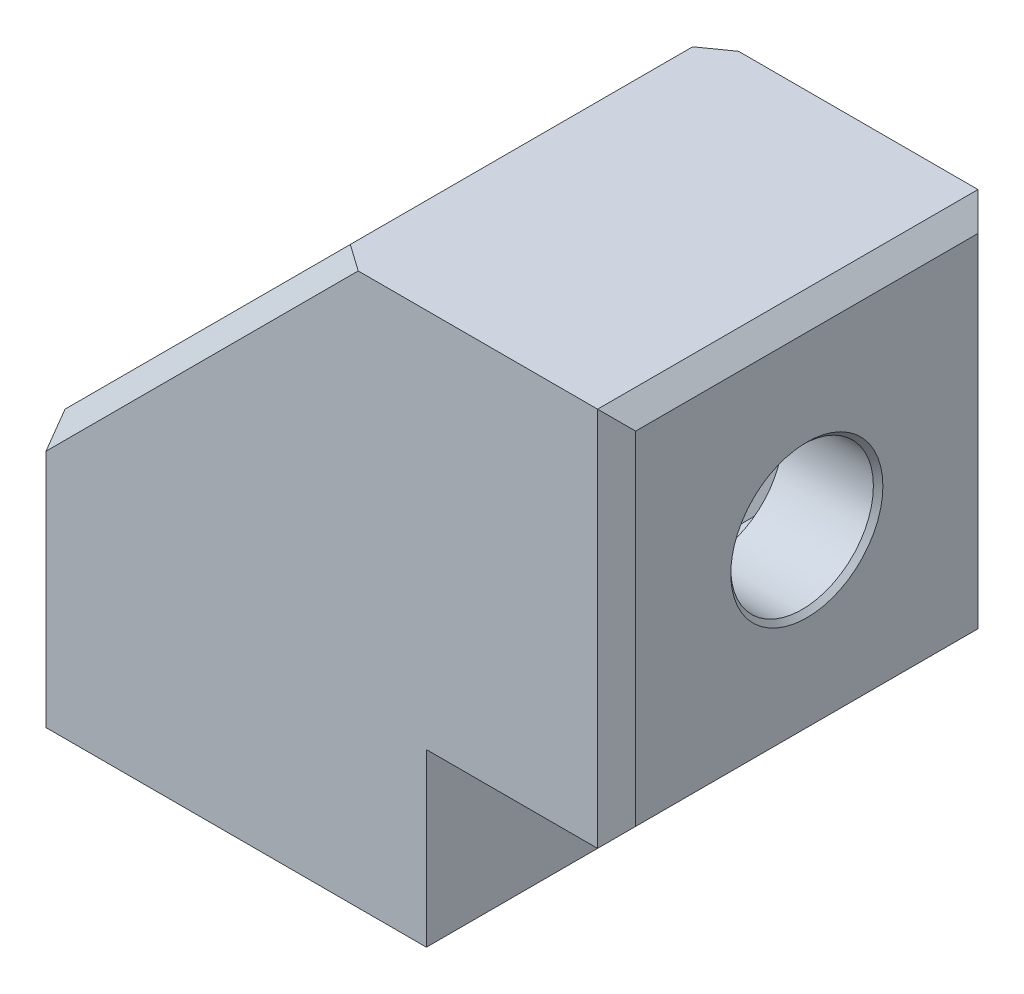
ISO-10303-21;
HEADER;
FILE_DESCRIPTION(('STEP AP214'),'2;1');
FILE_NAME('part.step','',(''),(''),'','','');
FILE_SCHEMA(('AUTOMOTIVE_DESIGN { 1 0 10303 214 1 1 1 1 }'));
ENDSEC;
DATA;
#1=APPLICATION_CONTEXT('core data for automotive mechanical design processes');
#2=APPLICATION_PROTOCOL_DEFINITION('international standard','automotive_design',2000,#1);
#3=PRODUCT_CONTEXT('',#1,'mechanical');
#4=PRODUCT('Part','Part','',(#3));
#5=PRODUCT_RELATED_PRODUCT_CATEGORY('part','',(#4));
#6=PRODUCT_DEFINITION_FORMATION('','',#4);
#7=PRODUCT_DEFINITION_CONTEXT('part definition',#1,'design');
#8=PRODUCT_DEFINITION('design','',#6,#7);
#9=PRODUCT_DEFINITION_SHAPE('','',#8);
#10=(LENGTH_UNIT() NAMED_UNIT(*) SI_UNIT(.MILLI.,.METRE.));
#11=(NAMED_UNIT(*) PLANE_ANGLE_UNIT() SI_UNIT($,.RADIAN.));
#12=(NAMED_UNIT(*) SI_UNIT($,.STERADIAN.) SOLID_ANGLE_UNIT());
#13=UNCERTAINTY_MEASURE_WITH_UNIT(LENGTH_MEASURE(1.E-05),#10,'distance_accuracy_value','');
#14=(GEOMETRIC_REPRESENTATION_CONTEXT(3) GLOBAL_UNCERTAINTY_ASSIGNED_CONTEXT((#13)) GLOBAL_UNIT_ASSIGNED_CONTEXT((#10,
#11,#12)) REPRESENTATION_CONTEXT('',''));
#15=CARTESIAN_POINT('',(0.,0.,0.));
#16=DIRECTION('',(0.,0.,1.));
#17=DIRECTION('',(1.,0.,0.));
#18=AXIS2_PLACEMENT_3D('',#15,#16,#17);
#19=CARTESIAN_POINT('',(0.,0.,50.8));
#20=DIRECTION('',(1.,0.,0.));
#21=DIRECTION('',(0.,0.,-1.));
#22=AXIS2_PLACEMENT_3D('',#19,#20,#21);
#23=PLANE('',#22);
#24=DIRECTION('',(0.,0.,-1.));
#25=VECTOR('',#24,1.);
#26=CARTESIAN_POINT('',(0.,38.1,50.8));
#27=LINE('',#26,#25);
#28=CARTESIAN_POINT('',(0.,38.1,48.26));
#29=VERTEX_POINT('',#28);
#30=CARTESIAN_POINT('',(0.,38.1,2.54));
#31=VERTEX_POINT('',#30);
#32=EDGE_CURVE('E230',#29,#31,#27,.T.);
#33=ORIENTED_EDGE('',*,*,#32,.T.);
#34=DIRECTION('',(0.,-0.816496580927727,-0.577350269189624));
#35=VECTOR('',#34,1.);
#36=CARTESIAN_POINT('',(0.,38.1,2.54));
#37=LINE('',#36,#35);
#38=CARTESIAN_POINT('',(0.,34.5078975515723,0.));
#39=VERTEX_POINT('',#38);
#40=EDGE_CURVE('E387',#31,#39,#37,.T.);
#41=ORIENTED_EDGE('',*,*,#40,.T.);
#42=DIRECTION('',(0.,-1.,0.));
#43=VECTOR('',#42,1.);
#44=CARTESIAN_POINT('',(0.,0.,0.));
#45=LINE('',#44,#43);
#46=CARTESIAN_POINT('',(0.,2.54,0.));
#47=VERTEX_POINT('',#46);
#48=EDGE_CURVE('E234',#39,#47,#45,.T.);
#49=ORIENTED_EDGE('',*,*,#48,.T.);
#50=DIRECTION('',(0.,0.,1.));
#51=VECTOR('',#50,1.);
#52=CARTESIAN_POINT('',(0.,2.54,50.8));
#53=LINE('',#52,#51);
#54=CARTESIAN_POINT('',(0.,2.54,50.8));
#55=VERTEX_POINT('',#54);
#56=EDGE_CURVE('E380',#47,#55,#53,.T.);
#57=ORIENTED_EDGE('',*,*,#56,.T.);
#58=DIRECTION('',(0.,-1.,0.));
#59=VECTOR('',#58,1.);
#60=CARTESIAN_POINT('',(0.,0.,50.8));
#61=LINE('',#60,#59);
#62=CARTESIAN_POINT('',(0.,34.5078975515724,50.8));
#63=VERTEX_POINT('',#62);
#64=EDGE_CURVE('E207',#63,#55,#61,.T.);
#65=ORIENTED_EDGE('',*,*,#64,.F.);
#66=DIRECTION('',(0.,-0.816496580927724,0.577350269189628));
#67=VECTOR('',#66,1.);
#68=CARTESIAN_POINT('',(0.,23.0052650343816,58.9335894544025));
#69=LINE('',#68,#67);
#70=EDGE_CURVE('E384',#63,#29,#69,.F.);
#71=ORIENTED_EDGE('',*,*,#70,.T.);
#72=EDGE_LOOP('',(#33,#41,#49,#57,#65,#71));
#73=FACE_BOUND('',#72,.T.);
#74=ADVANCED_FACE('F55',(#73),#23,.F.);
#75=CARTESIAN_POINT('',(0.,0.,50.8));
#76=DIRECTION('',(0.,1.,0.));
#77=DIRECTION('',(-1.,0.,0.));
#78=AXIS2_PLACEMENT_3D('',#75,#76,#77);
#79=PLANE('',#78);
#80=DIRECTION('',(-1.,0.,0.));
#81=VECTOR('',#80,1.);
#82=CARTESIAN_POINT('',(0.,0.,48.26));
#83=LINE('',#82,#81);
#84=CARTESIAN_POINT('',(48.26,0.,48.26));
#85=VERTEX_POINT('',#84);
#86=CARTESIAN_POINT('',(2.54000000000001,0.,48.26));
#87=VERTEX_POINT('',#86);
#88=EDGE_CURVE('E390',#85,#87,#83,.T.);
#89=ORIENTED_EDGE('',*,*,#88,.T.);
#90=DIRECTION('',(0.,0.,-1.));
#91=VECTOR('',#90,1.);
#92=CARTESIAN_POINT('',(2.54000000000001,0.,50.8));
#93=LINE('',#92,#91);
#94=CARTESIAN_POINT('',(2.54000000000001,0.,2.54000000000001));
#95=VERTEX_POINT('',#94);
#96=EDGE_CURVE('E65',#87,#95,#93,.T.);
#97=ORIENTED_EDGE('',*,*,#96,.T.);
#98=DIRECTION('',(1.,0.,0.));
#99=VECTOR('',#98,1.);
#100=CARTESIAN_POINT('',(50.8,0.,2.54000000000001));
#101=LINE('',#100,#99);
#102=CARTESIAN_POINT('',(48.26,0.,2.54000000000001));
#103=VERTEX_POINT('',#102);
#104=EDGE_CURVE('E80',#95,#103,#101,.T.);
#105=ORIENTED_EDGE('',*,*,#104,.T.);
#106=DIRECTION('',(0.,0.,1.));
#107=VECTOR('',#106,1.);
#108=CARTESIAN_POINT('',(48.26,0.,50.8));
#109=LINE('',#108,#107);
#110=EDGE_CURVE('E393',#103,#85,#109,.T.);
#111=ORIENTED_EDGE('',*,*,#110,.T.);
#112=EDGE_LOOP('',(#89,#97,#105,#111));
#113=FACE_BOUND('',#112,.T.);
#114=CARTESIAN_POINT('',(25.4,0.,25.4));
#115=DIRECTION('',(0.,-1.,0.));
#116=DIRECTION('',(0.,0.,-1.));
#117=AXIS2_PLACEMENT_3D('',#114,#115,#116);
#118=CIRCLE('',#117,10.16);
#119=CARTESIAN_POINT('',(25.4,0.,15.24));
#120=VERTEX_POINT('',#119);
#121=EDGE_CURVE('E579',#120,#120,#118,.T.);
#122=ORIENTED_EDGE('',*,*,#121,.F.);
#123=EDGE_LOOP('',(#122));
#124=FACE_BOUND('',#123,.T.);
#125=ADVANCED_FACE('F477',(#113,#124),#79,.F.);
#126=CARTESIAN_POINT('',(50.8,0.,50.8));
#127=DIRECTION('',(-1.,0.,0.));
#128=DIRECTION('',(0.,0.,1.));
#129=AXIS2_PLACEMENT_3D('',#126,#127,#128);
#130=PLANE('',#129);
#131=DIRECTION('',(0.,1.,0.));
#132=VECTOR('',#131,1.);
#133=CARTESIAN_POINT('',(50.8,0.,50.8));
#134=LINE('',#133,#132);
#135=CARTESIAN_POINT('',(50.8,2.54000000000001,50.8));
#136=VERTEX_POINT('',#135);
#137=CARTESIAN_POINT('',(50.8,25.4,50.8));
#138=VERTEX_POINT('',#137);
#139=EDGE_CURVE('E196',#136,#138,#134,.T.);
#140=ORIENTED_EDGE('',*,*,#139,.F.);
#141=DIRECTION('',(0.,0.,-1.));
#142=VECTOR('',#141,1.);
#143=CARTESIAN_POINT('',(50.8,2.54000000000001,50.8));
#144=LINE('',#143,#142);
#145=CARTESIAN_POINT('',(50.8,2.54000000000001,0.));
#146=VERTEX_POINT('',#145);
#147=EDGE_CURVE('E13',#136,#146,#144,.T.);
#148=ORIENTED_EDGE('',*,*,#147,.T.);
#149=DIRECTION('',(0.,1.,0.));
#150=VECTOR('',#149,1.);
#151=CARTESIAN_POINT('',(50.8,0.,0.));
#152=LINE('',#151,#150);
#153=CARTESIAN_POINT('',(50.8,25.4,0.));
#154=VERTEX_POINT('',#153);
#155=EDGE_CURVE('E213',#146,#154,#152,.T.);
#156=ORIENTED_EDGE('',*,*,#155,.T.);
#157=DIRECTION('',(0.,0.,-1.));
#158=VECTOR('',#157,1.);
#159=CARTESIAN_POINT('',(50.8,25.4,50.8));
#160=LINE('',#159,#158);
#161=EDGE_CURVE('E210',#138,#154,#160,.T.);
#162=ORIENTED_EDGE('',*,*,#161,.F.);
#163=EDGE_LOOP('',(#140,#148,#156,#162));
#164=FACE_BOUND('',#163,.T.);
#165=ADVANCED_FACE('F211',(#164),#130,.F.);
#166=CARTESIAN_POINT('',(76.2,25.4,50.8));
#167=DIRECTION('',(0.,1.,0.));
#168=DIRECTION('',(-1.,0.,0.));
#169=AXIS2_PLACEMENT_3D('',#166,#167,#168);
#170=PLANE('',#169);
#171=DIRECTION('',(1.,0.,0.));
#172=VECTOR('',#171,1.);
#173=CARTESIAN_POINT('',(76.2,25.4,0.));
#174=LINE('',#173,#172);
#175=CARTESIAN_POINT('',(73.66,25.4,0.));
#176=VERTEX_POINT('',#175);
#177=EDGE_CURVE('E241',#154,#176,#174,.T.);
#178=ORIENTED_EDGE('',*,*,#177,.T.);
#179=DIRECTION('',(0.,0.,1.));
#180=VECTOR('',#179,1.);
#181=CARTESIAN_POINT('',(73.66,25.4,50.8));
#182=LINE('',#181,#180);
#183=CARTESIAN_POINT('',(73.66,25.4,50.8));
#184=VERTEX_POINT('',#183);
#185=EDGE_CURVE('E224',#176,#184,#182,.T.);
#186=ORIENTED_EDGE('',*,*,#185,.T.);
#187=DIRECTION('',(1.,0.,0.));
#188=VECTOR('',#187,1.);
#189=CARTESIAN_POINT('',(76.2,25.4,50.8));
#190=LINE('',#189,#188);
#191=EDGE_CURVE('E200',#138,#184,#190,.T.);
#192=ORIENTED_EDGE('',*,*,#191,.F.);
#193=ORIENTED_EDGE('',*,*,#161,.T.);
#194=EDGE_LOOP('',(#178,#186,#192,#193));
#195=FACE_BOUND('',#194,.T.);
#196=ADVANCED_FACE('F222',(#195),#170,.F.);
#197=CARTESIAN_POINT('',(76.2,25.4,50.8));
#198=DIRECTION('',(-1.,0.,0.));
#199=DIRECTION('',(0.,0.,1.));
#200=AXIS2_PLACEMENT_3D('',#197,#198,#199);
#201=PLANE('',#200);
#202=DIRECTION('',(0.,-1.,0.));
#203=VECTOR('',#202,1.);
#204=CARTESIAN_POINT('',(76.2,25.4,48.26));
#205=LINE('',#204,#203);
#206=CARTESIAN_POINT('',(76.2,73.66,48.26));
#207=VERTEX_POINT('',#206);
#208=CARTESIAN_POINT('',(76.2,27.94,48.26));
#209=VERTEX_POINT('',#208);
#210=EDGE_CURVE('E337',#207,#209,#205,.T.);
#211=ORIENTED_EDGE('',*,*,#210,.T.);
#212=DIRECTION('',(0.,0.,-1.));
#213=VECTOR('',#212,1.);
#214=CARTESIAN_POINT('',(76.2,27.94,50.8));
#215=LINE('',#214,#213);
#216=CARTESIAN_POINT('',(76.2,27.94,2.54));
#217=VERTEX_POINT('',#216);
#218=EDGE_CURVE('E340',#209,#217,#215,.T.);
#219=ORIENTED_EDGE('',*,*,#218,.T.);
#220=DIRECTION('',(0.,1.,0.));
#221=VECTOR('',#220,1.);
#222=CARTESIAN_POINT('',(76.2,76.2,2.54));
#223=LINE('',#222,#221);
#224=CARTESIAN_POINT('',(76.2,73.66,2.54));
#225=VERTEX_POINT('',#224);
#226=EDGE_CURVE('E257',#217,#225,#223,.T.);
#227=ORIENTED_EDGE('',*,*,#226,.T.);
#228=DIRECTION('',(0.,0.,1.));
#229=VECTOR('',#228,1.);
#230=CARTESIAN_POINT('',(76.2,73.66,50.8));
#231=LINE('',#230,#229);
#232=EDGE_CURVE('E334',#225,#207,#231,.T.);
#233=ORIENTED_EDGE('',*,*,#232,.T.);
#234=EDGE_LOOP('',(#211,#219,#227,#233));
#235=FACE_BOUND('',#234,.T.);
#236=CARTESIAN_POINT('',(76.2,50.8,25.4));
#237=DIRECTION('',(1.,0.,0.));
#238=DIRECTION('',(0.,0.,-1.));
#239=AXIS2_PLACEMENT_3D('',#236,#237,#238);
#240=CIRCLE('',#239,10.16);
#241=CARTESIAN_POINT('',(76.2,50.8,15.24));
#242=VERTEX_POINT('',#241);
#243=EDGE_CURVE('E598',#242,#242,#240,.T.);
#244=ORIENTED_EDGE('',*,*,#243,.F.);
#245=EDGE_LOOP('',(#244));
#246=FACE_BOUND('',#245,.T.);
#247=ADVANCED_FACE('F449',(#235,#246),#201,.F.);
#248=CARTESIAN_POINT('',(38.1,76.2,50.8));
#249=DIRECTION('',(0.,-1.,0.));
#250=DIRECTION('',(0.,0.,-1.));
#251=AXIS2_PLACEMENT_3D('',#248,#249,#250);
#252=PLANE('',#251);
#253=DIRECTION('',(-1.,0.,0.));
#254=VECTOR('',#253,1.);
#255=CARTESIAN_POINT('',(38.1,76.2,50.8));
#256=LINE('',#255,#254);
#257=CARTESIAN_POINT('',(73.66,76.2,50.8));
#258=VERTEX_POINT('',#257);
#259=CARTESIAN_POINT('',(41.6921024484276,76.2,50.8));
#260=VERTEX_POINT('',#259);
#261=EDGE_CURVE('E226',#258,#260,#256,.T.);
#262=ORIENTED_EDGE('',*,*,#261,.F.);
#263=DIRECTION('',(0.,0.,-1.));
#264=VECTOR('',#263,1.);
#265=CARTESIAN_POINT('',(73.66,76.2,50.8));
#266=LINE('',#265,#264);
#267=CARTESIAN_POINT('',(73.66,76.2,0.));
#268=VERTEX_POINT('',#267);
#269=EDGE_CURVE('E361',#258,#268,#266,.T.);
#270=ORIENTED_EDGE('',*,*,#269,.T.);
#271=DIRECTION('',(-1.,0.,0.));
#272=VECTOR('',#271,1.);
#273=CARTESIAN_POINT('',(38.1,76.2,0.));
#274=LINE('',#273,#272);
#275=CARTESIAN_POINT('',(41.6921024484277,76.2,0.));
#276=VERTEX_POINT('',#275);
#277=EDGE_CURVE('E244',#268,#276,#274,.T.);
#278=ORIENTED_EDGE('',*,*,#277,.T.);
#279=DIRECTION('',(-0.816496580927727,0.,0.577350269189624));
#280=VECTOR('',#279,1.);
#281=CARTESIAN_POINT('',(12.6999999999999,76.2,20.5005122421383));
#282=LINE('',#281,#280);
#283=CARTESIAN_POINT('',(38.1,76.2,2.54));
#284=VERTEX_POINT('',#283);
#285=EDGE_CURVE('E358',#276,#284,#282,.T.);
#286=ORIENTED_EDGE('',*,*,#285,.T.);
#287=DIRECTION('',(0.,0.,-1.));
#288=VECTOR('',#287,1.);
#289=CARTESIAN_POINT('',(38.1,76.2,50.8));
#290=LINE('',#289,#288);
#291=CARTESIAN_POINT('',(38.1,76.2,48.26));
#292=VERTEX_POINT('',#291);
#293=EDGE_CURVE('E219',#292,#284,#290,.T.);
#294=ORIENTED_EDGE('',*,*,#293,.F.);
#295=DIRECTION('',(-0.816496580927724,0.,-0.577350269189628));
#296=VECTOR('',#295,1.);
#297=CARTESIAN_POINT('',(2.3947349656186,76.2,23.0125649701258));
#298=LINE('',#297,#296);
#299=EDGE_CURVE('E355',#292,#260,#298,.F.);
#300=ORIENTED_EDGE('',*,*,#299,.T.);
#301=EDGE_LOOP('',(#262,#270,#278,#286,#294,#300));
#302=FACE_BOUND('',#301,.T.);
#303=ADVANCED_FACE('F459',(#302),#252,.F.);
#304=CARTESIAN_POINT('',(0.,38.1,50.8));
#305=DIRECTION('',(0.707106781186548,-0.707106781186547,0.));
#306=DIRECTION('',(0.707106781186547,0.707106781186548,0.));
#307=AXIS2_PLACEMENT_3D('',#304,#305,#306);
#308=PLANE('',#307);
#309=CARTESIAN_POINT('',(30.0177694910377,68.1177694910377,25.4));
#310=DIRECTION('',(-0.707106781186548,0.707106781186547,0.));
#311=DIRECTION('',(-0.707106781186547,-0.707106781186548,0.));
#312=AXIS2_PLACEMENT_3D('',#309,#310,#311);
#313=CIRCLE('',#312,2.55269999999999);
#314=CARTESIAN_POINT('',(28.2127380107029,66.3127380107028,25.4));
#315=VERTEX_POINT('',#314);
#316=EDGE_CURVE('E331',#315,#315,#313,.T.);
#317=ORIENTED_EDGE('',*,*,#316,.F.);
#318=EDGE_LOOP('',(#317));
#319=FACE_BOUND('',#318,.T.);
#320=CARTESIAN_POINT('',(18.3434365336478,56.4434365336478,25.4));
#321=DIRECTION('',(-0.707106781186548,0.707106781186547,0.));
#322=DIRECTION('',(-0.707106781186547,-0.707106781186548,0.));
#323=AXIS2_PLACEMENT_3D('',#320,#321,#322);
#324=CIRCLE('',#323,10.16);
#325=CARTESIAN_POINT('',(11.1592316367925,49.2592316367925,25.4));
#326=VERTEX_POINT('',#325);
#327=EDGE_CURVE('E330',#326,#326,#324,.T.);
#328=ORIENTED_EDGE('',*,*,#327,.F.);
#329=EDGE_LOOP('',(#328));
#330=FACE_BOUND('',#329,.T.);
#331=ORIENTED_EDGE('',*,*,#293,.T.);
#332=DIRECTION('',(-0.707106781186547,-0.707106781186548,0.));
#333=VECTOR('',#332,1.);
#334=CARTESIAN_POINT('',(0.,38.1,2.54));
#335=LINE('',#334,#333);
#336=EDGE_CURVE('E376',#284,#31,#335,.T.);
#337=ORIENTED_EDGE('',*,*,#336,.T.);
#338=ORIENTED_EDGE('',*,*,#32,.F.);
#339=DIRECTION('',(0.707106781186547,0.707106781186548,0.));
#340=VECTOR('',#339,1.);
#341=CARTESIAN_POINT('',(0.,38.1,48.26));
#342=LINE('',#341,#340);
#343=EDGE_CURVE('E373',#29,#292,#342,.T.);
#344=ORIENTED_EDGE('',*,*,#343,.T.);
#345=EDGE_LOOP('',(#331,#337,#338,#344));
#346=FACE_BOUND('',#345,.T.);
#347=ADVANCED_FACE('F615',(#319,#330,#346),#308,.F.);
#348=CARTESIAN_POINT('',(0.,0.,50.8));
#349=DIRECTION('',(0.,0.,-1.));
#350=DIRECTION('',(-1.,0.,0.));
#351=AXIS2_PLACEMENT_3D('',#348,#349,#350);
#352=PLANE('',#351);
#353=ORIENTED_EDGE('',*,*,#191,.T.);
#354=DIRECTION('',(0.,1.,0.));
#355=VECTOR('',#354,1.);
#356=CARTESIAN_POINT('',(73.66,0.,50.8));
#357=LINE('',#356,#355);
#358=EDGE_CURVE('E352',#184,#258,#357,.T.);
#359=ORIENTED_EDGE('',*,*,#358,.T.);
#360=ORIENTED_EDGE('',*,*,#261,.T.);
#361=DIRECTION('',(-0.707106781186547,-0.707106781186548,0.));
#362=VECTOR('',#361,1.);
#363=CARTESIAN_POINT('',(-17.2539487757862,17.2539487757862,50.8));
#364=LINE('',#363,#362);
#365=EDGE_CURVE('E348',#260,#63,#364,.T.);
#366=ORIENTED_EDGE('',*,*,#365,.T.);
#367=ORIENTED_EDGE('',*,*,#64,.T.);
#368=DIRECTION('',(1.,0.,0.));
#369=VECTOR('',#368,1.);
#370=CARTESIAN_POINT('',(0.,2.54,50.8));
#371=LINE('',#370,#369);
#372=EDGE_CURVE('E203',#55,#136,#371,.T.);
#373=ORIENTED_EDGE('',*,*,#372,.T.);
#374=ORIENTED_EDGE('',*,*,#139,.T.);
#375=EDGE_LOOP('',(#353,#359,#360,#366,#367,#373,#374));
#376=FACE_BOUND('',#375,.T.);
#377=ADVANCED_FACE('F198',(#376),#352,.F.);
#378=CARTESIAN_POINT('',(0.,0.,0.));
#379=DIRECTION('',(0.,0.,-1.));
#380=DIRECTION('',(-1.,0.,0.));
#381=AXIS2_PLACEMENT_3D('',#378,#379,#380);
#382=PLANE('',#381);
#383=ORIENTED_EDGE('',*,*,#277,.F.);
#384=DIRECTION('',(0.,-1.,0.));
#385=VECTOR('',#384,1.);
#386=CARTESIAN_POINT('',(73.66,25.4,0.));
#387=LINE('',#386,#385);
#388=EDGE_CURVE('E370',#268,#176,#387,.T.);
#389=ORIENTED_EDGE('',*,*,#388,.T.);
#390=ORIENTED_EDGE('',*,*,#177,.F.);
#391=ORIENTED_EDGE('',*,*,#155,.F.);
#392=DIRECTION('',(-1.,0.,0.));
#393=VECTOR('',#392,1.);
#394=CARTESIAN_POINT('',(0.,2.54,0.));
#395=LINE('',#394,#393);
#396=EDGE_CURVE('E364',#146,#47,#395,.T.);
#397=ORIENTED_EDGE('',*,*,#396,.T.);
#398=ORIENTED_EDGE('',*,*,#48,.F.);
#399=DIRECTION('',(0.707106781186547,0.707106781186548,0.));
#400=VECTOR('',#399,1.);
#401=CARTESIAN_POINT('',(39.8960512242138,74.4039487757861,0.));
#402=LINE('',#401,#400);
#403=EDGE_CURVE('E367',#39,#276,#402,.T.);
#404=ORIENTED_EDGE('',*,*,#403,.T.);
#405=EDGE_LOOP('',(#383,#389,#390,#391,#397,#398,#404));
#406=FACE_BOUND('',#405,.T.);
#407=ADVANCED_FACE('F434',(#406),#382,.T.);
#408=CARTESIAN_POINT('',(76.2,50.8,25.4));
#409=DIRECTION('',(1.,0.,0.));
#410=DIRECTION('',(0.,0.,-1.));
#411=AXIS2_PLACEMENT_3D('',#408,#409,#410);
#412=CYLINDRICAL_SURFACE('',#411,9.525);
#413=CARTESIAN_POINT('',(75.565,50.8,25.4));
#414=DIRECTION('',(1.,0.,0.));
#415=DIRECTION('',(0.,0.,-1.));
#416=AXIS2_PLACEMENT_3D('',#413,#414,#415);
#417=CIRCLE('',#416,9.52499999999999);
#418=CARTESIAN_POINT('',(75.565,50.8,15.875));
#419=VERTEX_POINT('',#418);
#420=EDGE_CURVE('E602',#419,#419,#417,.T.);
#421=ORIENTED_EDGE('',*,*,#420,.T.);
#422=EDGE_LOOP('',(#421));
#423=FACE_BOUND('',#422,.T.);
#424=CARTESIAN_POINT('',(63.5,50.8,25.4));
#425=DIRECTION('',(-1.,0.,0.));
#426=DIRECTION('',(0.,0.,1.));
#427=AXIS2_PLACEMENT_3D('',#424,#425,#426);
#428=CIRCLE('',#427,9.525);
#429=CARTESIAN_POINT('',(63.5,50.8,34.925));
#430=VERTEX_POINT('',#429);
#431=EDGE_CURVE('E238',#430,#430,#428,.T.);
#432=ORIENTED_EDGE('',*,*,#431,.T.);
#433=EDGE_LOOP('',(#432));
#434=FACE_BOUND('',#433,.T.);
#435=ADVANCED_FACE('F667',(#423,#434),#412,.F.);
#436=CARTESIAN_POINT('',(76.2,50.8,25.4));
#437=DIRECTION('',(1.,0.,0.));
#438=DIRECTION('',(0.,0.,-1.));
#439=AXIS2_PLACEMENT_3D('',#436,#437,#438);
#440=CONICAL_SURFACE('',#439,10.16,0.785398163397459);
#441=ORIENTED_EDGE('',*,*,#420,.F.);
#442=EDGE_LOOP('',(#441));
#443=FACE_BOUND('',#442,.T.);
#444=ORIENTED_EDGE('',*,*,#243,.T.);
#445=EDGE_LOOP('',(#444));
#446=FACE_BOUND('',#445,.T.);
#447=ADVANCED_FACE('F490',(#443,#446),#440,.F.);
#448=CARTESIAN_POINT('',(2.54,0.,50.8));
#449=DIRECTION('',(1.,0.,0.));
#450=DIRECTION('',(0.,0.,-1.));
#451=AXIS2_PLACEMENT_3D('',#448,#449,#450);
#452=PLANE('',#451);
#453=DIRECTION('',(0.,-1.,0.));
#454=VECTOR('',#453,1.);
#455=CARTESIAN_POINT('',(2.54,0.,2.54));
#456=LINE('',#455,#454);
#457=CARTESIAN_POINT('',(2.54,37.0478975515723,2.54));
#458=VERTEX_POINT('',#457);
#459=CARTESIAN_POINT('',(2.54,12.7,2.54));
#460=VERTEX_POINT('',#459);
#461=EDGE_CURVE('E218',#458,#460,#456,.T.);
#462=ORIENTED_EDGE('',*,*,#461,.F.);
#463=DIRECTION('',(0.,0.,-1.));
#464=VECTOR('',#463,1.);
#465=CARTESIAN_POINT('',(2.54,37.0478975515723,50.8));
#466=LINE('',#465,#464);
#467=CARTESIAN_POINT('',(2.54,37.0478975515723,48.26));
#468=VERTEX_POINT('',#467);
#469=EDGE_CURVE('E319',#468,#458,#466,.T.);
#470=ORIENTED_EDGE('',*,*,#469,.F.);
#471=DIRECTION('',(0.,-1.,0.));
#472=VECTOR('',#471,1.);
#473=CARTESIAN_POINT('',(2.54,0.,48.26));
#474=LINE('',#473,#472);
#475=CARTESIAN_POINT('',(2.54,12.7,48.26));
#476=VERTEX_POINT('',#475);
#477=EDGE_CURVE('E273',#468,#476,#474,.T.);
#478=ORIENTED_EDGE('',*,*,#477,.T.);
#479=DIRECTION('',(0.,0.,-1.));
#480=VECTOR('',#479,1.);
#481=CARTESIAN_POINT('',(2.54,12.7,50.8));
#482=LINE('',#481,#480);
#483=EDGE_CURVE('E312',#476,#460,#482,.T.);
#484=ORIENTED_EDGE('',*,*,#483,.T.);
#485=EDGE_LOOP('',(#462,#470,#478,#484));
#486=FACE_BOUND('',#485,.T.);
#487=ADVANCED_FACE('F486',(#486),#452,.T.);
#488=CARTESIAN_POINT('',(0.,12.7,50.8));
#489=DIRECTION('',(0.,1.,0.));
#490=DIRECTION('',(-1.,0.,0.));
#491=AXIS2_PLACEMENT_3D('',#488,#489,#490);
#492=PLANE('',#491);
#493=CARTESIAN_POINT('',(25.4,12.7,25.4));
#494=DIRECTION('',(0.,1.,0.));
#495=DIRECTION('',(-1.,0.,0.));
#496=AXIS2_PLACEMENT_3D('',#493,#494,#495);
#497=CIRCLE('',#496,9.52499999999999);
#498=CARTESIAN_POINT('',(15.875,12.7,25.4));
#499=VERTEX_POINT('',#498);
#500=EDGE_CURVE('E588',#499,#499,#497,.T.);
#501=ORIENTED_EDGE('',*,*,#500,.F.);
#502=EDGE_LOOP('',(#501));
#503=FACE_BOUND('',#502,.T.);
#504=DIRECTION('',(1.,0.,0.));
#505=VECTOR('',#504,1.);
#506=CARTESIAN_POINT('',(0.,12.7,2.54));
#507=LINE('',#506,#505);
#508=CARTESIAN_POINT('',(48.26,12.7,2.54));
#509=VERTEX_POINT('',#508);
#510=EDGE_CURVE('E316',#460,#509,#507,.T.);
#511=ORIENTED_EDGE('',*,*,#510,.F.);
#512=ORIENTED_EDGE('',*,*,#483,.F.);
#513=DIRECTION('',(1.,0.,0.));
#514=VECTOR('',#513,1.);
#515=CARTESIAN_POINT('',(0.,12.7,48.26));
#516=LINE('',#515,#514);
#517=CARTESIAN_POINT('',(48.26,12.7,48.26));
#518=VERTEX_POINT('',#517);
#519=EDGE_CURVE('E270',#476,#518,#516,.T.);
#520=ORIENTED_EDGE('',*,*,#519,.T.);
#521=DIRECTION('',(0.,0.,-1.));
#522=VECTOR('',#521,1.);
#523=CARTESIAN_POINT('',(48.26,12.7,50.8));
#524=LINE('',#523,#522);
#525=EDGE_CURVE('E305',#518,#509,#524,.T.);
#526=ORIENTED_EDGE('',*,*,#525,.T.);
#527=EDGE_LOOP('',(#511,#512,#520,#526));
#528=FACE_BOUND('',#527,.T.);
#529=ADVANCED_FACE('F489',(#503,#528),#492,.T.);
#530=CARTESIAN_POINT('',(48.26,0.,50.8));
#531=DIRECTION('',(-1.,0.,0.));
#532=DIRECTION('',(0.,0.,1.));
#533=AXIS2_PLACEMENT_3D('',#530,#531,#532);
#534=PLANE('',#533);
#535=DIRECTION('',(0.,1.,0.));
#536=VECTOR('',#535,1.);
#537=CARTESIAN_POINT('',(48.26,0.,2.54));
#538=LINE('',#537,#536);
#539=CARTESIAN_POINT('',(48.26,27.94,2.54));
#540=VERTEX_POINT('',#539);
#541=EDGE_CURVE('E309',#509,#540,#538,.T.);
#542=ORIENTED_EDGE('',*,*,#541,.F.);
#543=ORIENTED_EDGE('',*,*,#525,.F.);
#544=DIRECTION('',(0.,1.,0.));
#545=VECTOR('',#544,1.);
#546=CARTESIAN_POINT('',(48.26,0.,48.26));
#547=LINE('',#546,#545);
#548=CARTESIAN_POINT('',(48.26,27.94,48.26));
#549=VERTEX_POINT('',#548);
#550=EDGE_CURVE('E267',#518,#549,#547,.T.);
#551=ORIENTED_EDGE('',*,*,#550,.T.);
#552=DIRECTION('',(0.,0.,-1.));
#553=VECTOR('',#552,1.);
#554=CARTESIAN_POINT('',(48.26,27.94,50.8));
#555=LINE('',#554,#553);
#556=EDGE_CURVE('E298',#549,#540,#555,.T.);
#557=ORIENTED_EDGE('',*,*,#556,.T.);
#558=EDGE_LOOP('',(#542,#543,#551,#557));
#559=FACE_BOUND('',#558,.T.);
#560=ADVANCED_FACE('F494',(#559),#534,.T.);
#561=CARTESIAN_POINT('',(76.2,27.94,50.8));
#562=DIRECTION('',(0.,1.,0.));
#563=DIRECTION('',(-1.,0.,0.));
#564=AXIS2_PLACEMENT_3D('',#561,#562,#563);
#565=PLANE('',#564);
#566=DIRECTION('',(1.,0.,0.));
#567=VECTOR('',#566,1.);
#568=CARTESIAN_POINT('',(0.,27.94,2.54));
#569=LINE('',#568,#567);
#570=CARTESIAN_POINT('',(63.5,27.94,2.54));
#571=VERTEX_POINT('',#570);
#572=EDGE_CURVE('E302',#540,#571,#569,.T.);
#573=ORIENTED_EDGE('',*,*,#572,.F.);
#574=ORIENTED_EDGE('',*,*,#556,.F.);
#575=DIRECTION('',(1.,0.,0.));
#576=VECTOR('',#575,1.);
#577=CARTESIAN_POINT('',(0.,27.94,48.26));
#578=LINE('',#577,#576);
#579=CARTESIAN_POINT('',(63.5,27.94,48.26));
#580=VERTEX_POINT('',#579);
#581=EDGE_CURVE('E264',#549,#580,#578,.T.);
#582=ORIENTED_EDGE('',*,*,#581,.T.);
#583=DIRECTION('',(0.,0.,-1.));
#584=VECTOR('',#583,1.);
#585=CARTESIAN_POINT('',(63.5,27.94,50.8));
#586=LINE('',#585,#584);
#587=EDGE_CURVE('E291',#580,#571,#586,.T.);
#588=ORIENTED_EDGE('',*,*,#587,.T.);
#589=EDGE_LOOP('',(#573,#574,#582,#588));
#590=FACE_BOUND('',#589,.T.);
#591=ADVANCED_FACE('F498',(#590),#565,.T.);
#592=CARTESIAN_POINT('',(63.5,25.4,50.8));
#593=DIRECTION('',(-1.,0.,0.));
#594=DIRECTION('',(0.,0.,1.));
#595=AXIS2_PLACEMENT_3D('',#592,#593,#594);
#596=PLANE('',#595);
#597=ORIENTED_EDGE('',*,*,#431,.F.);
#598=EDGE_LOOP('',(#597));
#599=FACE_BOUND('',#598,.T.);
#600=DIRECTION('',(0.,1.,0.));
#601=VECTOR('',#600,1.);
#602=CARTESIAN_POINT('',(63.5,0.,2.54));
#603=LINE('',#602,#601);
#604=CARTESIAN_POINT('',(63.5,73.66,2.54));
#605=VERTEX_POINT('',#604);
#606=EDGE_CURVE('E295',#571,#605,#603,.T.);
#607=ORIENTED_EDGE('',*,*,#606,.F.);
#608=ORIENTED_EDGE('',*,*,#587,.F.);
#609=DIRECTION('',(0.,1.,0.));
#610=VECTOR('',#609,1.);
#611=CARTESIAN_POINT('',(63.5,0.,48.26));
#612=LINE('',#611,#610);
#613=CARTESIAN_POINT('',(63.5,73.66,48.26));
#614=VERTEX_POINT('',#613);
#615=EDGE_CURVE('E261',#580,#614,#612,.T.);
#616=ORIENTED_EDGE('',*,*,#615,.T.);
#617=DIRECTION('',(0.,0.,-1.));
#618=VECTOR('',#617,1.);
#619=CARTESIAN_POINT('',(63.5,73.66,50.8));
#620=LINE('',#619,#618);
#621=EDGE_CURVE('E284',#614,#605,#620,.T.);
#622=ORIENTED_EDGE('',*,*,#621,.T.);
#623=EDGE_LOOP('',(#607,#608,#616,#622));
#624=FACE_BOUND('',#623,.T.);
#625=ADVANCED_FACE('F502',(#599,#624),#596,.T.);
#626=CARTESIAN_POINT('',(38.1,73.66,50.8));
#627=DIRECTION('',(0.,-1.,0.));
#628=DIRECTION('',(0.,0.,-1.));
#629=AXIS2_PLACEMENT_3D('',#626,#627,#628);
#630=PLANE('',#629);
#631=DIRECTION('',(-1.,0.,0.));
#632=VECTOR('',#631,1.);
#633=CARTESIAN_POINT('',(0.,73.66,2.54));
#634=LINE('',#633,#632);
#635=CARTESIAN_POINT('',(39.1521024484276,73.66,2.54));
#636=VERTEX_POINT('',#635);
#637=EDGE_CURVE('E288',#605,#636,#634,.T.);
#638=ORIENTED_EDGE('',*,*,#637,.F.);
#639=ORIENTED_EDGE('',*,*,#621,.F.);
#640=DIRECTION('',(-1.,0.,0.));
#641=VECTOR('',#640,1.);
#642=CARTESIAN_POINT('',(0.,73.66,48.26));
#643=LINE('',#642,#641);
#644=CARTESIAN_POINT('',(39.1521024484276,73.66,48.26));
#645=VERTEX_POINT('',#644);
#646=EDGE_CURVE('E258',#614,#645,#643,.T.);
#647=ORIENTED_EDGE('',*,*,#646,.T.);
#648=DIRECTION('',(0.,0.,-1.));
#649=VECTOR('',#648,1.);
#650=CARTESIAN_POINT('',(39.1521024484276,73.66,50.8));
#651=LINE('',#650,#649);
#652=EDGE_CURVE('E277',#645,#636,#651,.T.);
#653=ORIENTED_EDGE('',*,*,#652,.T.);
#654=EDGE_LOOP('',(#638,#639,#647,#653));
#655=FACE_BOUND('',#654,.T.);
#656=ADVANCED_FACE('F506',(#655),#630,.T.);
#657=CARTESIAN_POINT('',(1.79605122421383,36.3039487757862,50.8));
#658=DIRECTION('',(0.707106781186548,-0.707106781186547,0.));
#659=DIRECTION('',(0.707106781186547,0.707106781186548,0.));
#660=AXIS2_PLACEMENT_3D('',#657,#658,#659);
#661=PLANE('',#660);
#662=CARTESIAN_POINT('',(31.8138207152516,66.3217182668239,25.4));
#663=DIRECTION('',(0.707106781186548,-0.707106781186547,0.));
#664=DIRECTION('',(0.707106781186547,0.707106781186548,0.));
#665=AXIS2_PLACEMENT_3D('',#662,#663,#664);
#666=CIRCLE('',#665,2.55269999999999);
#667=CARTESIAN_POINT('',(33.6188521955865,68.1267497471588,25.4));
#668=VERTEX_POINT('',#667);
#669=EDGE_CURVE('E326',#668,#668,#666,.T.);
#670=ORIENTED_EDGE('',*,*,#669,.F.);
#671=EDGE_LOOP('',(#670));
#672=FACE_BOUND('',#671,.T.);
#673=CARTESIAN_POINT('',(20.1394877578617,54.647385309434,25.4));
#674=DIRECTION('',(0.707106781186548,-0.707106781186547,0.));
#675=DIRECTION('',(0.707106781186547,0.707106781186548,0.));
#676=AXIS2_PLACEMENT_3D('',#673,#674,#675);
#677=CIRCLE('',#676,9.525);
#678=CARTESIAN_POINT('',(26.8746798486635,61.3825774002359,25.4));
#679=VERTEX_POINT('',#678);
#680=EDGE_CURVE('E583',#679,#679,#677,.T.);
#681=ORIENTED_EDGE('',*,*,#680,.F.);
#682=EDGE_LOOP('',(#681));
#683=FACE_BOUND('',#682,.T.);
#684=DIRECTION('',(-0.707106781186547,-0.707106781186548,0.));
#685=VECTOR('',#684,1.);
#686=CARTESIAN_POINT('',(-17.2539487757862,17.2539487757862,2.54));
#687=LINE('',#686,#685);
#688=EDGE_CURVE('E281',#636,#458,#687,.T.);
#689=ORIENTED_EDGE('',*,*,#688,.F.);
#690=ORIENTED_EDGE('',*,*,#652,.F.);
#691=DIRECTION('',(-0.707106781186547,-0.707106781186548,0.));
#692=VECTOR('',#691,1.);
#693=CARTESIAN_POINT('',(-17.2539487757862,17.2539487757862,48.26));
#694=LINE('',#693,#692);
#695=EDGE_CURVE('E254',#645,#468,#694,.T.);
#696=ORIENTED_EDGE('',*,*,#695,.T.);
#697=ORIENTED_EDGE('',*,*,#469,.T.);
#698=EDGE_LOOP('',(#689,#690,#696,#697));
#699=FACE_BOUND('',#698,.T.);
#700=ADVANCED_FACE('F510',(#672,#683,#699),#661,.T.);
#701=CARTESIAN_POINT('',(0.,0.,48.26));
#702=DIRECTION('',(0.,0.,-1.));
#703=DIRECTION('',(-1.,0.,0.));
#704=AXIS2_PLACEMENT_3D('',#701,#702,#703);
#705=PLANE('',#704);
#706=ORIENTED_EDGE('',*,*,#477,.F.);
#707=ORIENTED_EDGE('',*,*,#695,.F.);
#708=ORIENTED_EDGE('',*,*,#646,.F.);
#709=ORIENTED_EDGE('',*,*,#615,.F.);
#710=ORIENTED_EDGE('',*,*,#581,.F.);
#711=ORIENTED_EDGE('',*,*,#550,.F.);
#712=ORIENTED_EDGE('',*,*,#519,.F.);
#713=EDGE_LOOP('',(#706,#707,#708,#709,#710,#711,#712));
#714=FACE_BOUND('',#713,.T.);
#715=ADVANCED_FACE('F514',(#714),#705,.T.);
#716=CARTESIAN_POINT('',(0.,0.,2.54));
#717=DIRECTION('',(0.,0.,-1.));
#718=DIRECTION('',(-1.,0.,0.));
#719=AXIS2_PLACEMENT_3D('',#716,#717,#718);
#720=PLANE('',#719);
#721=ORIENTED_EDGE('',*,*,#461,.T.);
#722=ORIENTED_EDGE('',*,*,#510,.T.);
#723=ORIENTED_EDGE('',*,*,#541,.T.);
#724=ORIENTED_EDGE('',*,*,#572,.T.);
#725=ORIENTED_EDGE('',*,*,#606,.T.);
#726=ORIENTED_EDGE('',*,*,#637,.T.);
#727=ORIENTED_EDGE('',*,*,#688,.T.);
#728=EDGE_LOOP('',(#721,#722,#723,#724,#725,#726,#727));
#729=FACE_BOUND('',#728,.T.);
#730=ADVANCED_FACE('F518',(#729),#720,.F.);
#731=CARTESIAN_POINT('',(25.4,0.,25.4));
#732=DIRECTION('',(0.,-1.,0.));
#733=DIRECTION('',(0.,0.,-1.));
#734=AXIS2_PLACEMENT_3D('',#731,#732,#733);
#735=CYLINDRICAL_SURFACE('',#734,9.52499999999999);
#736=CARTESIAN_POINT('',(25.4,0.635000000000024,25.4));
#737=DIRECTION('',(0.,-1.,0.));
#738=DIRECTION('',(0.,0.,-1.));
#739=AXIS2_PLACEMENT_3D('',#736,#737,#738);
#740=CIRCLE('',#739,9.52499999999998);
#741=CARTESIAN_POINT('',(25.4,0.635000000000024,15.875));
#742=VERTEX_POINT('',#741);
#743=EDGE_CURVE('E582',#742,#742,#740,.T.);
#744=ORIENTED_EDGE('',*,*,#743,.T.);
#745=EDGE_LOOP('',(#744));
#746=FACE_BOUND('',#745,.T.);
#747=ORIENTED_EDGE('',*,*,#500,.T.);
#748=EDGE_LOOP('',(#747));
#749=FACE_BOUND('',#748,.T.);
#750=ADVANCED_FACE('F522',(#746,#749),#735,.F.);
#751=CARTESIAN_POINT('',(25.4,0.,25.4));
#752=DIRECTION('',(0.,-1.,0.));
#753=DIRECTION('',(0.,0.,-1.));
#754=AXIS2_PLACEMENT_3D('',#751,#752,#753);
#755=CONICAL_SURFACE('',#754,10.16,0.785398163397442);
#756=ORIENTED_EDGE('',*,*,#743,.F.);
#757=EDGE_LOOP('',(#756));
#758=FACE_BOUND('',#757,.T.);
#759=ORIENTED_EDGE('',*,*,#121,.T.);
#760=EDGE_LOOP('',(#759));
#761=FACE_BOUND('',#760,.T.);
#762=ADVANCED_FACE('F730',(#758,#761),#755,.F.);
#763=CARTESIAN_POINT('',(18.3434365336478,56.4434365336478,25.4));
#764=DIRECTION('',(-0.707106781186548,0.707106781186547,0.));
#765=DIRECTION('',(-0.707106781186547,-0.707106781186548,0.));
#766=AXIS2_PLACEMENT_3D('',#763,#764,#765);
#767=CYLINDRICAL_SURFACE('',#766,9.525);
#768=CARTESIAN_POINT('',(18.7202030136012,56.0666700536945,25.4));
#769=DIRECTION('',(-0.707106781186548,0.707106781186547,0.));
#770=DIRECTION('',(-0.707106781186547,-0.707106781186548,0.));
#771=AXIS2_PLACEMENT_3D('',#768,#769,#770);
#772=CIRCLE('',#771,9.525);
#773=CARTESIAN_POINT('',(11.9850109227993,49.3314779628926,25.4));
#774=VERTEX_POINT('',#773);
#775=EDGE_CURVE('E591',#774,#774,#772,.T.);
#776=ORIENTED_EDGE('',*,*,#775,.T.);
#777=EDGE_LOOP('',(#776));
#778=FACE_BOUND('',#777,.T.);
#779=ORIENTED_EDGE('',*,*,#680,.T.);
#780=EDGE_LOOP('',(#779));
#781=FACE_BOUND('',#780,.T.);
#782=ADVANCED_FACE('F739',(#778,#781),#767,.F.);
#783=CARTESIAN_POINT('',(18.3434365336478,56.4434365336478,25.4));
#784=DIRECTION('',(-0.707106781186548,0.707106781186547,0.));
#785=DIRECTION('',(-0.707106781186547,-0.707106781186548,0.));
#786=AXIS2_PLACEMENT_3D('',#783,#784,#785);
#787=CONICAL_SURFACE('',#786,10.16,0.872664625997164);
#788=ORIENTED_EDGE('',*,*,#775,.F.);
#789=EDGE_LOOP('',(#788));
#790=FACE_BOUND('',#789,.T.);
#791=ORIENTED_EDGE('',*,*,#327,.T.);
#792=EDGE_LOOP('',(#791));
#793=FACE_BOUND('',#792,.T.);
#794=ADVANCED_FACE('F472',(#790,#793),#787,.F.);
#795=CARTESIAN_POINT('',(30.0177694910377,68.1177694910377,25.4));
#796=DIRECTION('',(-0.707106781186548,0.707106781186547,0.));
#797=DIRECTION('',(-0.707106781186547,-0.707106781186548,0.));
#798=AXIS2_PLACEMENT_3D('',#795,#796,#797);
#799=CYLINDRICAL_SURFACE('',#798,2.55269999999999);
#800=ORIENTED_EDGE('',*,*,#669,.T.);
#801=EDGE_LOOP('',(#800));
#802=FACE_BOUND('',#801,.T.);
#803=ORIENTED_EDGE('',*,*,#316,.T.);
#804=EDGE_LOOP('',(#803));
#805=FACE_BOUND('',#804,.T.);
#806=ADVANCED_FACE('F465',(#802,#805),#799,.F.);
#807=CARTESIAN_POINT('',(73.66,76.2,50.8));
#808=DIRECTION('',(-0.707106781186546,-0.70710678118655,0.));
#809=DIRECTION('',(0.,0.,-1.));
#810=AXIS2_PLACEMENT_3D('',#807,#808,#809);
#811=PLANE('',#810);
#812=DIRECTION('',(-0.577350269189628,0.577350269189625,-0.577350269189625));
#813=VECTOR('',#812,1.);
#814=CARTESIAN_POINT('',(92.2866666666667,57.5733333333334,18.6266666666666));
#815=LINE('',#814,#813);
#816=EDGE_CURVE('E406',#268,#225,#815,.F.);
#817=ORIENTED_EDGE('',*,*,#816,.F.);
#818=ORIENTED_EDGE('',*,*,#269,.F.);
#819=DIRECTION('',(0.577350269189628,-0.577350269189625,-0.577350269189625));
#820=VECTOR('',#819,1.);
#821=CARTESIAN_POINT('',(73.66,76.2,50.8));
#822=LINE('',#821,#820);
#823=EDGE_CURVE('E410',#207,#258,#822,.F.);
#824=ORIENTED_EDGE('',*,*,#823,.F.);
#825=ORIENTED_EDGE('',*,*,#232,.F.);
#826=EDGE_LOOP('',(#817,#818,#824,#825));
#827=FACE_BOUND('',#826,.T.);
#828=ADVANCED_FACE('F463',(#827),#811,.F.);
#829=CARTESIAN_POINT('',(73.66,0.,50.8));
#830=DIRECTION('',(-0.707106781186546,0.,-0.70710678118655));
#831=DIRECTION('',(0.,1.,0.));
#832=AXIS2_PLACEMENT_3D('',#829,#830,#831);
#833=PLANE('',#832);
#834=ORIENTED_EDGE('',*,*,#823,.T.);
#835=ORIENTED_EDGE('',*,*,#358,.F.);
#836=DIRECTION('',(0.577350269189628,0.577350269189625,-0.577350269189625));
#837=VECTOR('',#836,1.);
#838=CARTESIAN_POINT('',(65.1933333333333,16.9333333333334,59.2666666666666));
#839=LINE('',#838,#837);
#840=EDGE_CURVE('E403',#209,#184,#839,.F.);
#841=ORIENTED_EDGE('',*,*,#840,.F.);
#842=ORIENTED_EDGE('',*,*,#210,.F.);
#843=EDGE_LOOP('',(#834,#835,#841,#842));
#844=FACE_BOUND('',#843,.T.);
#845=ADVANCED_FACE('F454',(#844),#833,.F.);
#846=CARTESIAN_POINT('',(76.2,25.4,2.54));
#847=DIRECTION('',(0.707106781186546,0.,-0.70710678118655));
#848=DIRECTION('',(0.,-1.,0.));
#849=AXIS2_PLACEMENT_3D('',#846,#847,#848);
#850=PLANE('',#849);
#851=ORIENTED_EDGE('',*,*,#816,.T.);
#852=ORIENTED_EDGE('',*,*,#226,.F.);
#853=DIRECTION('',(0.577350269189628,0.577350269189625,0.577350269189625));
#854=VECTOR('',#853,1.);
#855=CARTESIAN_POINT('',(75.3533333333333,27.0933333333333,1.69333333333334));
#856=LINE('',#855,#854);
#857=EDGE_CURVE('E400',#176,#217,#856,.T.);
#858=ORIENTED_EDGE('',*,*,#857,.F.);
#859=ORIENTED_EDGE('',*,*,#388,.F.);
#860=EDGE_LOOP('',(#851,#852,#858,#859));
#861=FACE_BOUND('',#860,.T.);
#862=ADVANCED_FACE('F445',(#861),#850,.T.);
#863=CARTESIAN_POINT('',(76.2,27.94,50.8));
#864=DIRECTION('',(-0.707106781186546,0.70710678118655,0.));
#865=DIRECTION('',(0.,0.,-1.));
#866=AXIS2_PLACEMENT_3D('',#863,#864,#865);
#867=PLANE('',#866);
#868=ORIENTED_EDGE('',*,*,#840,.T.);
#869=ORIENTED_EDGE('',*,*,#185,.F.);
#870=ORIENTED_EDGE('',*,*,#857,.T.);
#871=ORIENTED_EDGE('',*,*,#218,.F.);
#872=EDGE_LOOP('',(#868,#869,#870,#871));
#873=FACE_BOUND('',#872,.T.);
#874=ADVANCED_FACE('F439',(#873),#867,.F.);
#875=CARTESIAN_POINT('',(0.,38.1,2.54));
#876=DIRECTION('',(-0.499999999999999,0.499999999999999,-0.707106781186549));
#877=DIRECTION('',(0.707106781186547,0.707106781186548,0.));
#878=AXIS2_PLACEMENT_3D('',#875,#876,#877);
#879=PLANE('',#878);
#880=ORIENTED_EDGE('',*,*,#285,.F.);
#881=ORIENTED_EDGE('',*,*,#403,.F.);
#882=ORIENTED_EDGE('',*,*,#40,.F.);
#883=ORIENTED_EDGE('',*,*,#336,.F.);
#884=EDGE_LOOP('',(#880,#881,#882,#883));
#885=FACE_BOUND('',#884,.T.);
#886=ADVANCED_FACE('F526',(#885),#879,.T.);
#887=CARTESIAN_POINT('',(-17.2539487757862,17.2539487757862,50.8));
#888=DIRECTION('',(0.500000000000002,-0.500000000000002,-0.707106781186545));
#889=DIRECTION('',(-0.707106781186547,-0.707106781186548,0.));
#890=AXIS2_PLACEMENT_3D('',#887,#888,#889);
#891=PLANE('',#890);
#892=ORIENTED_EDGE('',*,*,#299,.F.);
#893=ORIENTED_EDGE('',*,*,#343,.F.);
#894=ORIENTED_EDGE('',*,*,#70,.F.);
#895=ORIENTED_EDGE('',*,*,#365,.F.);
#896=EDGE_LOOP('',(#892,#893,#894,#895));
#897=FACE_BOUND('',#896,.T.);
#898=ADVANCED_FACE('F542',(#897),#891,.F.);
#899=CARTESIAN_POINT('',(50.8,2.54000000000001,50.8));
#900=DIRECTION('',(-0.707106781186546,0.70710678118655,0.));
#901=DIRECTION('',(0.,0.,-1.));
#902=AXIS2_PLACEMENT_3D('',#899,#900,#901);
#903=PLANE('',#902);
#904=DIRECTION('',(-0.577350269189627,-0.577350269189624,0.577350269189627));
#905=VECTOR('',#904,1.);
#906=CARTESIAN_POINT('',(33.8666666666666,-14.3933333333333,16.9333333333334));
#907=LINE('',#906,#905);
#908=EDGE_CURVE('E418',#146,#103,#907,.T.);
#909=ORIENTED_EDGE('',*,*,#908,.F.);
#910=ORIENTED_EDGE('',*,*,#147,.F.);
#911=DIRECTION('',(0.577350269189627,0.577350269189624,0.577350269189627));
#912=VECTOR('',#911,1.);
#913=CARTESIAN_POINT('',(33.8666666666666,-14.3933333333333,33.8666666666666));
#914=LINE('',#913,#912);
#915=EDGE_CURVE('E59',#85,#136,#914,.T.);
#916=ORIENTED_EDGE('',*,*,#915,.F.);
#917=ORIENTED_EDGE('',*,*,#110,.F.);
#918=EDGE_LOOP('',(#909,#910,#916,#917));
#919=FACE_BOUND('',#918,.T.);
#920=ADVANCED_FACE('F57',(#919),#903,.F.);
#921=CARTESIAN_POINT('',(0.,2.54,50.8));
#922=DIRECTION('',(0.,0.70710678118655,-0.707106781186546));
#923=DIRECTION('',(1.,0.,0.));
#924=AXIS2_PLACEMENT_3D('',#921,#922,#923);
#925=PLANE('',#924);
#926=ORIENTED_EDGE('',*,*,#915,.T.);
#927=ORIENTED_EDGE('',*,*,#372,.F.);
#928=DIRECTION('',(0.577350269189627,-0.577350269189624,-0.577350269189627));
#929=VECTOR('',#928,1.);
#930=CARTESIAN_POINT('',(0.,2.54,50.8));
#931=LINE('',#930,#929);
#932=EDGE_CURVE('E416',#87,#55,#931,.F.);
#933=ORIENTED_EDGE('',*,*,#932,.F.);
#934=ORIENTED_EDGE('',*,*,#88,.F.);
#935=EDGE_LOOP('',(#926,#927,#933,#934));
#936=FACE_BOUND('',#935,.T.);
#937=ADVANCED_FACE('F429',(#936),#925,.F.);
#938=CARTESIAN_POINT('',(0.,0.,2.54000000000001));
#939=DIRECTION('',(0.,-0.70710678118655,-0.707106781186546));
#940=DIRECTION('',(-1.,0.,0.));
#941=AXIS2_PLACEMENT_3D('',#938,#939,#940);
#942=PLANE('',#941);
#943=ORIENTED_EDGE('',*,*,#908,.T.);
#944=ORIENTED_EDGE('',*,*,#104,.F.);
#945=DIRECTION('',(0.577350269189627,-0.577350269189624,0.577350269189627));
#946=VECTOR('',#945,1.);
#947=CARTESIAN_POINT('',(1.69333333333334,0.846666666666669,1.69333333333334));
#948=LINE('',#947,#946);
#949=EDGE_CURVE('E73',#47,#95,#948,.T.);
#950=ORIENTED_EDGE('',*,*,#949,.F.);
#951=ORIENTED_EDGE('',*,*,#396,.F.);
#952=EDGE_LOOP('',(#943,#944,#950,#951));
#953=FACE_BOUND('',#952,.T.);
#954=ADVANCED_FACE('F561',(#953),#942,.T.);
#955=CARTESIAN_POINT('',(2.54000000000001,0.,50.8));
#956=DIRECTION('',(0.707106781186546,0.707106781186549,0.));
#957=DIRECTION('',(0.,0.,-1.));
#958=AXIS2_PLACEMENT_3D('',#955,#956,#957);
#959=PLANE('',#958);
#960=ORIENTED_EDGE('',*,*,#932,.T.);
#961=ORIENTED_EDGE('',*,*,#56,.F.);
#962=ORIENTED_EDGE('',*,*,#949,.T.);
#963=ORIENTED_EDGE('',*,*,#96,.F.);
#964=EDGE_LOOP('',(#960,#961,#962,#963));
#965=FACE_BOUND('',#964,.T.);
#966=ADVANCED_FACE('F567',(#965),#959,.F.);
#967=CLOSED_SHELL('',(#74,#125,#165,#196,#247,#303,#347,#377,#407,#435,#447,#487,#529,#560,#591,
#625,#656,#700,#715,#730,#750,#762,#782,#794,#806,#828,#845,#862,#874,#886,#898,#920,#937,#954,#966));
#968=MANIFOLD_SOLID_BREP('B2',#967);
#969=ADVANCED_BREP_SHAPE_REPRESENTATION('',(#18,#968),#14);
#970=SHAPE_DEFINITION_REPRESENTATION(#9,#969);
ENDSEC;
END-ISO-10303-21;
